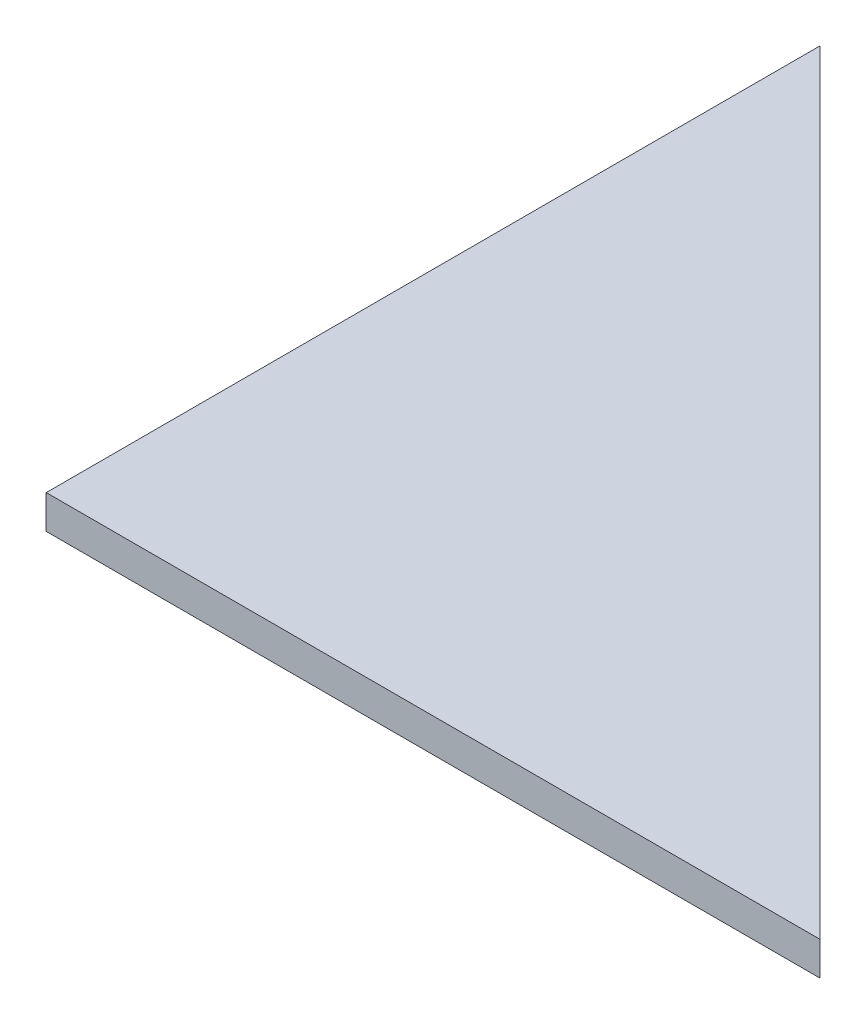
ISO-10303-21;
HEADER;
FILE_DESCRIPTION(('STEP AP214'),'2;1');
FILE_NAME('part.step','',(''),(''),'','','');
FILE_SCHEMA(('AUTOMOTIVE_DESIGN { 1 0 10303 214 1 1 1 1 }'));
ENDSEC;
DATA;
#1=APPLICATION_CONTEXT('core data for automotive mechanical design processes');
#2=APPLICATION_PROTOCOL_DEFINITION('international standard','automotive_design',2000,#1);
#3=PRODUCT_CONTEXT('',#1,'mechanical');
#4=PRODUCT('Part','Part','',(#3));
#5=PRODUCT_RELATED_PRODUCT_CATEGORY('part','',(#4));
#6=PRODUCT_DEFINITION_FORMATION('','',#4);
#7=PRODUCT_DEFINITION_CONTEXT('part definition',#1,'design');
#8=PRODUCT_DEFINITION('design','',#6,#7);
#9=PRODUCT_DEFINITION_SHAPE('','',#8);
#10=(LENGTH_UNIT() NAMED_UNIT(*) SI_UNIT(.MILLI.,.METRE.));
#11=(NAMED_UNIT(*) PLANE_ANGLE_UNIT() SI_UNIT($,.RADIAN.));
#12=(NAMED_UNIT(*) SI_UNIT($,.STERADIAN.) SOLID_ANGLE_UNIT());
#13=UNCERTAINTY_MEASURE_WITH_UNIT(LENGTH_MEASURE(1.E-05),#10,'distance_accuracy_value','');
#14=(GEOMETRIC_REPRESENTATION_CONTEXT(3) GLOBAL_UNCERTAINTY_ASSIGNED_CONTEXT((#13)) GLOBAL_UNIT_ASSIGNED_CONTEXT((#10,
#11,#12)) REPRESENTATION_CONTEXT('',''));
#15=CARTESIAN_POINT('',(0.,0.,0.));
#16=DIRECTION('',(0.,0.,1.));
#17=DIRECTION('',(1.,0.,0.));
#18=AXIS2_PLACEMENT_3D('',#15,#16,#17);
#19=CARTESIAN_POINT('',(0.,1.,-80.5));
#20=DIRECTION('',(0.,0.,-1.));
#21=DIRECTION('',(-1.,0.,0.));
#22=AXIS2_PLACEMENT_3D('',#19,#20,#21);
#23=PLANE('',#22);
#24=DIRECTION('',(1.,0.,0.));
#25=VECTOR('',#24,1.);
#26=CARTESIAN_POINT('',(0.,0.,-80.5));
#27=LINE('',#26,#25);
#28=CARTESIAN_POINT('',(0.,0.,-80.5));
#29=VERTEX_POINT('',#28);
#30=CARTESIAN_POINT('',(23.,0.,-80.5));
#31=VERTEX_POINT('',#30);
#32=EDGE_CURVE('E80',#29,#31,#27,.T.);
#33=ORIENTED_EDGE('',*,*,#32,.T.);
#34=DIRECTION('',(0.,-1.,0.));
#35=VECTOR('',#34,1.);
#36=CARTESIAN_POINT('',(23.,1.,-80.5));
#37=LINE('',#36,#35);
#38=CARTESIAN_POINT('',(23.,1.,-80.5));
#39=VERTEX_POINT('',#38);
#40=EDGE_CURVE('E11',#39,#31,#37,.T.);
#41=ORIENTED_EDGE('',*,*,#40,.F.);
#42=DIRECTION('',(1.,0.,0.));
#43=VECTOR('',#42,1.);
#44=CARTESIAN_POINT('',(0.,1.,-80.5));
#45=LINE('',#44,#43);
#46=CARTESIAN_POINT('',(0.,1.,-80.5));
#47=VERTEX_POINT('',#46);
#48=EDGE_CURVE('E75',#47,#39,#45,.T.);
#49=ORIENTED_EDGE('',*,*,#48,.F.);
#50=DIRECTION('',(0.,-1.,0.));
#51=VECTOR('',#50,1.);
#52=CARTESIAN_POINT('',(0.,1.,-80.5));
#53=LINE('',#52,#51);
#54=EDGE_CURVE('E50',#47,#29,#53,.T.);
#55=ORIENTED_EDGE('',*,*,#54,.T.);
#56=EDGE_LOOP('',(#33,#41,#49,#55));
#57=FACE_BOUND('',#56,.T.);
#58=ADVANCED_FACE('F34',(#57),#23,.F.);
#59=CARTESIAN_POINT('',(51.7500000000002,1.,-51.7499999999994));
#60=DIRECTION('',(-0.707106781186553,0.,0.707106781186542));
#61=DIRECTION('',(0.707106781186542,0.,0.707106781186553));
#62=AXIS2_PLACEMENT_3D('',#59,#60,#61);
#63=PLANE('',#62);
#64=DIRECTION('',(-0.707106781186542,0.,-0.707106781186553));
#65=VECTOR('',#64,1.);
#66=CARTESIAN_POINT('',(51.7500000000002,0.,-51.7499999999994));
#67=LINE('',#66,#65);
#68=CARTESIAN_POINT('',(0.,0.,-103.5));
#69=VERTEX_POINT('',#68);
#70=EDGE_CURVE('E83',#31,#69,#67,.T.);
#71=ORIENTED_EDGE('',*,*,#70,.T.);
#72=DIRECTION('',(0.,-1.,0.));
#73=VECTOR('',#72,1.);
#74=CARTESIAN_POINT('',(0.,1.,-103.5));
#75=LINE('',#74,#73);
#76=CARTESIAN_POINT('',(0.,1.,-103.5));
#77=VERTEX_POINT('',#76);
#78=EDGE_CURVE('E42',#77,#69,#75,.T.);
#79=ORIENTED_EDGE('',*,*,#78,.F.);
#80=DIRECTION('',(-0.707106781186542,0.,-0.707106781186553));
#81=VECTOR('',#80,1.);
#82=CARTESIAN_POINT('',(51.7500000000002,1.,-51.7499999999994));
#83=LINE('',#82,#81);
#84=EDGE_CURVE('E68',#39,#77,#83,.T.);
#85=ORIENTED_EDGE('',*,*,#84,.F.);
#86=ORIENTED_EDGE('',*,*,#40,.T.);
#87=EDGE_LOOP('',(#71,#79,#85,#86));
#88=FACE_BOUND('',#87,.T.);
#89=ADVANCED_FACE('F70',(#88),#63,.F.);
#90=CARTESIAN_POINT('',(0.,1.,0.));
#91=DIRECTION('',(-1.,0.,0.));
#92=DIRECTION('',(0.,0.,1.));
#93=AXIS2_PLACEMENT_3D('',#90,#91,#92);
#94=PLANE('',#93);
#95=DIRECTION('',(0.,0.,-1.));
#96=VECTOR('',#95,1.);
#97=CARTESIAN_POINT('',(0.,0.,0.));
#98=LINE('',#97,#96);
#99=EDGE_CURVE('E78',#29,#69,#98,.T.);
#100=ORIENTED_EDGE('',*,*,#99,.F.);
#101=ORIENTED_EDGE('',*,*,#54,.F.);
#102=DIRECTION('',(0.,0.,-1.));
#103=VECTOR('',#102,1.);
#104=CARTESIAN_POINT('',(0.,1.,0.));
#105=LINE('',#104,#103);
#106=EDGE_CURVE('E74',#47,#77,#105,.T.);
#107=ORIENTED_EDGE('',*,*,#106,.T.);
#108=ORIENTED_EDGE('',*,*,#78,.T.);
#109=EDGE_LOOP('',(#100,#101,#107,#108));
#110=FACE_BOUND('',#109,.T.);
#111=ADVANCED_FACE('F89',(#110),#94,.T.);
#112=CARTESIAN_POINT('',(0.,1.,0.));
#113=DIRECTION('',(0.,1.,0.));
#114=DIRECTION('',(0.,0.,1.));
#115=AXIS2_PLACEMENT_3D('',#112,#113,#114);
#116=PLANE('',#115);
#117=ORIENTED_EDGE('',*,*,#48,.T.);
#118=ORIENTED_EDGE('',*,*,#84,.T.);
#119=ORIENTED_EDGE('',*,*,#106,.F.);
#120=EDGE_LOOP('',(#117,#118,#119));
#121=FACE_BOUND('',#120,.T.);
#122=ADVANCED_FACE('F77',(#121),#116,.T.);
#123=CARTESIAN_POINT('',(0.,0.,0.));
#124=DIRECTION('',(0.,1.,0.));
#125=DIRECTION('',(0.,0.,1.));
#126=AXIS2_PLACEMENT_3D('',#123,#124,#125);
#127=PLANE('',#126);
#128=ORIENTED_EDGE('',*,*,#32,.F.);
#129=ORIENTED_EDGE('',*,*,#99,.T.);
#130=ORIENTED_EDGE('',*,*,#70,.F.);
#131=EDGE_LOOP('',(#128,#129,#130));
#132=FACE_BOUND('',#131,.T.);
#133=ADVANCED_FACE('F96',(#132),#127,.F.);
#134=CLOSED_SHELL('',(#58,#89,#111,#122,#133));
#135=MANIFOLD_SOLID_BREP('B2',#134);
#136=ADVANCED_BREP_SHAPE_REPRESENTATION('',(#18,#135),#14);
#137=SHAPE_DEFINITION_REPRESENTATION(#9,#136);
ENDSEC;
END-ISO-10303-21;
